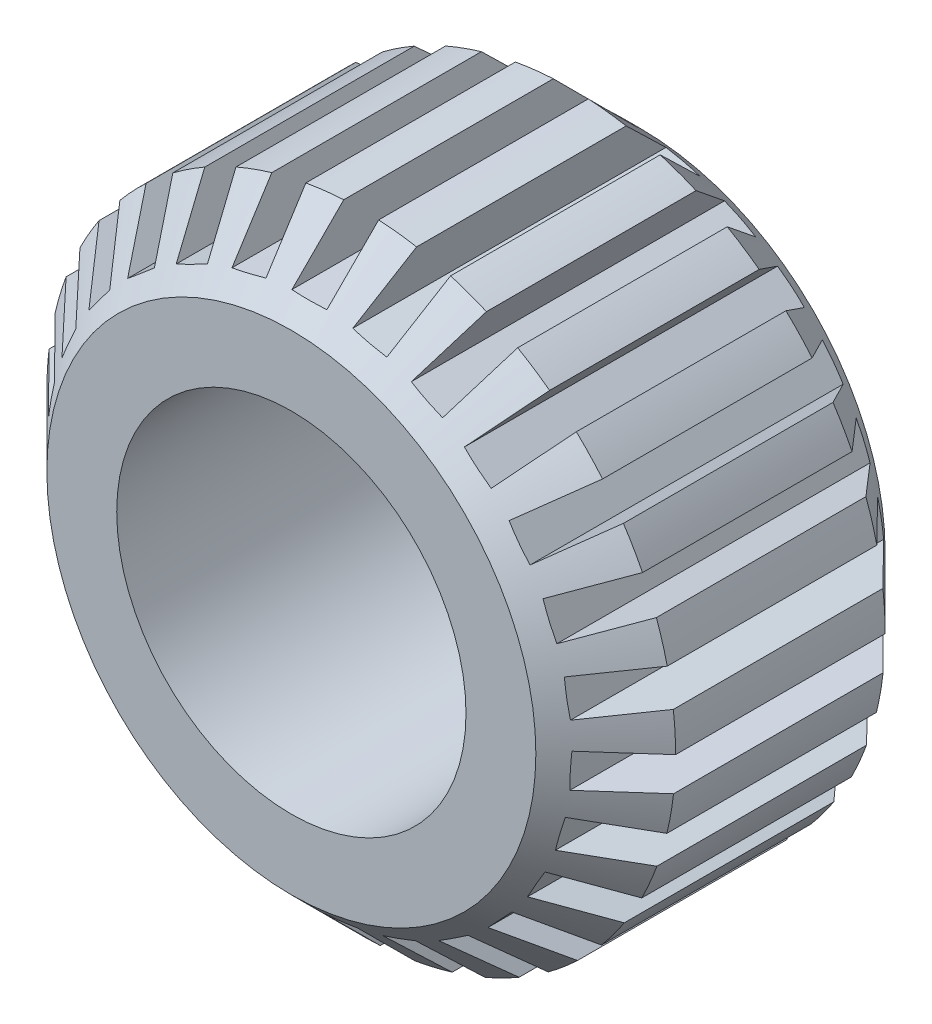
from build123d import *

# Parameters (mm, degrees)
CROQUIS1_R              = 9
CROQUIS1_R_2            = 5
SALIENTE_EXTRUIR2_DEPTH = 10
CHAFL_N1_SIZE           = 2
CORTAR_EXTRUIR1_DEPTH   = 17.186414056
MATRIZC1_COUNT          = 27


with BuildPart() as part:
    # Croquis1 → Saliente-Extruir2 (new body)
    with BuildSketch(Plane.XY):
        Circle(CROQUIS1_R)
        Circle(CROQUIS1_R_2, mode=Mode.SUBTRACT)
    extrude(amount=SALIENTE_EXTRUIR2_DEPTH)

    # Chafl_n1
    chafl_n1_edges = [part.edges().sort_by_distance(p)[0] for p in [
        (-9, 0, 10),
        (-9, 0, 0),
    ]]
    chamfer(chafl_n1_edges, length=CHAFL_N1_SIZE)

    # Croquis2 → Cortar-Extruir1 (cut, through all)
    with BuildSketch(Plane.XY):
        with BuildLine():
            Line((0.5, 7.5), (0.5, 8.986100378))
            ThreePointArc((0.5, 8.986100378), (0, 9), (-0.5, 8.986100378))
            Line((-0.5, 8.986100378), (-0.5, 7.5))
            Line((-0.5, 7.5), (0.5, 7.5))
        make_face()
    cortar_extruir1 = extrude(amount=CORTAR_EXTRUIR1_DEPTH, mode=Mode.SUBTRACT)

    # MatrizC1: Cortar-Extruir1 ×27 about axis
    matrizc1_axis = Axis((0, 0, 0), (0, 0, 1))
    for i in range(1, MATRIZC1_COUNT):
        add(cortar_extruir1.rotate(matrizc1_axis, i * 360 / MATRIZC1_COUNT), mode=Mode.SUBTRACT)


solid = part.part
